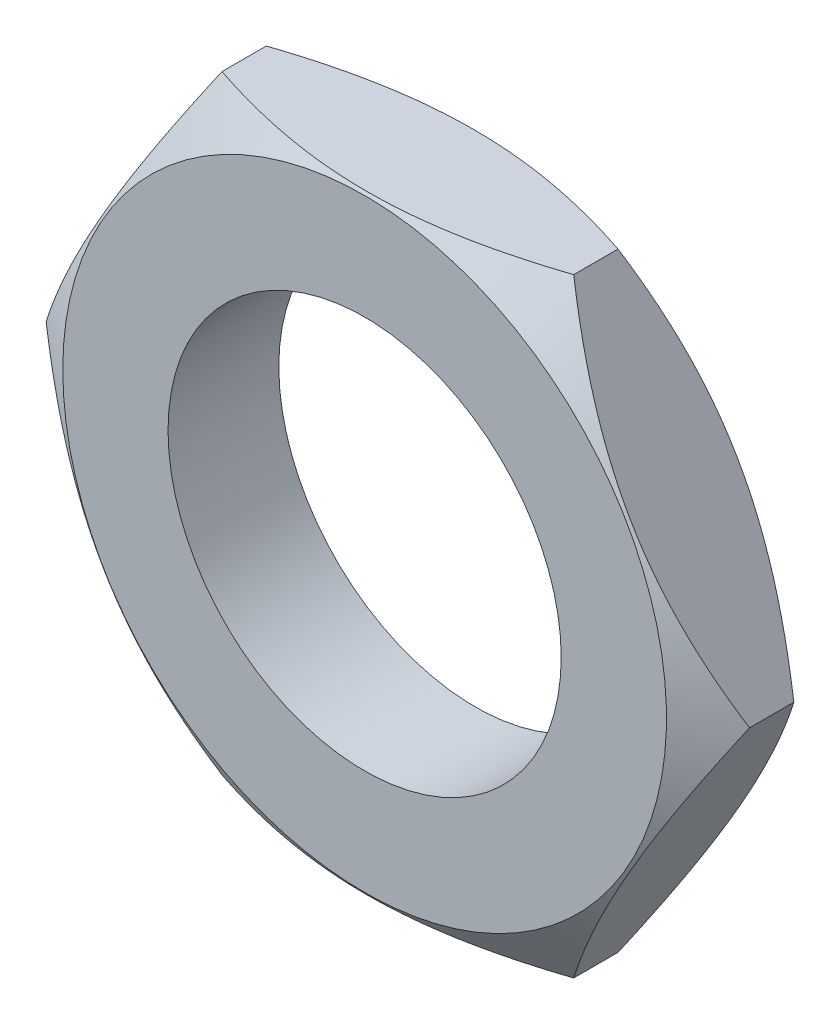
ISO-10303-21;
HEADER;
FILE_DESCRIPTION(('STEP AP214'),'2;1');
FILE_NAME('part.step','',(''),(''),'','','');
FILE_SCHEMA(('AUTOMOTIVE_DESIGN { 1 0 10303 214 1 1 1 1 }'));
ENDSEC;
DATA;
#1=APPLICATION_CONTEXT('core data for automotive mechanical design processes');
#2=APPLICATION_PROTOCOL_DEFINITION('international standard','automotive_design',2000,#1);
#3=PRODUCT_CONTEXT('',#1,'mechanical');
#4=PRODUCT('Part','Part','',(#3));
#5=PRODUCT_RELATED_PRODUCT_CATEGORY('part','',(#4));
#6=PRODUCT_DEFINITION_FORMATION('','',#4);
#7=PRODUCT_DEFINITION_CONTEXT('part definition',#1,'design');
#8=PRODUCT_DEFINITION('design','',#6,#7);
#9=PRODUCT_DEFINITION_SHAPE('','',#8);
#10=(LENGTH_UNIT() NAMED_UNIT(*) SI_UNIT(.MILLI.,.METRE.));
#11=(NAMED_UNIT(*) PLANE_ANGLE_UNIT() SI_UNIT($,.RADIAN.));
#12=(NAMED_UNIT(*) SI_UNIT($,.STERADIAN.) SOLID_ANGLE_UNIT());
#13=UNCERTAINTY_MEASURE_WITH_UNIT(LENGTH_MEASURE(1.E-05),#10,'distance_accuracy_value','');
#14=(GEOMETRIC_REPRESENTATION_CONTEXT(3) GLOBAL_UNCERTAINTY_ASSIGNED_CONTEXT((#13)) GLOBAL_UNIT_ASSIGNED_CONTEXT((#10,
#11,#12)) REPRESENTATION_CONTEXT('',''));
#15=CARTESIAN_POINT('',(0.,0.,0.));
#16=DIRECTION('',(0.,0.,1.));
#17=DIRECTION('',(1.,0.,0.));
#18=AXIS2_PLACEMENT_3D('',#15,#16,#17);
#19=CARTESIAN_POINT('',(0.,0.,-1.));
#20=DIRECTION('',(0.,0.,1.));
#21=DIRECTION('',(1.,0.,0.));
#22=AXIS2_PLACEMENT_3D('',#19,#20,#21);
#23=PLANE('',#22);
#24=CARTESIAN_POINT('',(0.,0.,-1.));
#25=DIRECTION('',(0.,0.,1.));
#26=DIRECTION('',(1.,0.,0.));
#27=AXIS2_PLACEMENT_3D('',#24,#25,#26);
#28=CIRCLE('',#27,3.55);
#29=CARTESIAN_POINT('',(3.55,0.,-1.));
#30=VERTEX_POINT('',#29);
#31=EDGE_CURVE('E218',#30,#30,#28,.T.);
#32=ORIENTED_EDGE('',*,*,#31,.T.);
#33=EDGE_LOOP('',(#32));
#34=FACE_BOUND('',#33,.T.);
#35=CARTESIAN_POINT('',(0.,0.,-1.));
#36=DIRECTION('',(0.,0.,-1.));
#37=DIRECTION('',(-1.,0.,0.));
#38=AXIS2_PLACEMENT_3D('',#35,#36,#37);
#39=CIRCLE('',#38,5.45085296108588);
#40=CARTESIAN_POINT('',(-5.45085296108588,0.,-1.));
#41=VERTEX_POINT('',#40);
#42=EDGE_CURVE('E106',#41,#41,#39,.T.);
#43=ORIENTED_EDGE('',*,*,#42,.T.);
#44=EDGE_LOOP('',(#43));
#45=FACE_BOUND('',#44,.T.);
#46=ADVANCED_FACE('F34',(#34,#45),#23,.F.);
#47=CARTESIAN_POINT('',(0.,0.,1.));
#48=DIRECTION('',(0.,0.,1.));
#49=DIRECTION('',(1.,0.,0.));
#50=AXIS2_PLACEMENT_3D('',#47,#48,#49);
#51=PLANE('',#50);
#52=CARTESIAN_POINT('',(0.,0.,1.));
#53=DIRECTION('',(0.,0.,1.));
#54=DIRECTION('',(1.,0.,0.));
#55=AXIS2_PLACEMENT_3D('',#52,#53,#54);
#56=CIRCLE('',#55,3.55);
#57=CARTESIAN_POINT('',(3.55,0.,1.));
#58=VERTEX_POINT('',#57);
#59=EDGE_CURVE('E113',#58,#58,#56,.T.);
#60=ORIENTED_EDGE('',*,*,#59,.F.);
#61=EDGE_LOOP('',(#60));
#62=FACE_BOUND('',#61,.T.);
#63=CARTESIAN_POINT('',(0.,0.,1.));
#64=DIRECTION('',(0.,0.,-1.));
#65=DIRECTION('',(-1.,0.,0.));
#66=AXIS2_PLACEMENT_3D('',#63,#64,#65);
#67=CIRCLE('',#66,5.45085296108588);
#68=CARTESIAN_POINT('',(-5.45085296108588,0.,1.));
#69=VERTEX_POINT('',#68);
#70=EDGE_CURVE('E205',#69,#69,#67,.T.);
#71=ORIENTED_EDGE('',*,*,#70,.F.);
#72=EDGE_LOOP('',(#71));
#73=FACE_BOUND('',#72,.T.);
#74=ADVANCED_FACE('F227',(#62,#73),#51,.T.);
#75=CARTESIAN_POINT('',(-3.17542648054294,-5.5,1.));
#76=DIRECTION('',(0.,1.,0.));
#77=DIRECTION('',(-1.,0.,0.));
#78=AXIS2_PLACEMENT_3D('',#75,#76,#77);
#79=PLANE('',#78);
#80=DIRECTION('',(0.,0.,-1.));
#81=VECTOR('',#80,1.);
#82=CARTESIAN_POINT('',(-3.17542648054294,-5.5,1.));
#83=LINE('',#82,#81);
#84=CARTESIAN_POINT('',(-3.17542648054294,-5.5,0.4));
#85=VERTEX_POINT('',#84);
#86=CARTESIAN_POINT('',(-3.17542648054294,-5.5,-0.4));
#87=VERTEX_POINT('',#86);
#88=EDGE_CURVE('E109',#85,#87,#83,.T.);
#89=ORIENTED_EDGE('',*,*,#88,.T.);
#90=CARTESIAN_POINT('',(-9.5547591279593,-5.5,2.71588024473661));
#91=CARTESIAN_POINT('',(-9.35509489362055,-5.5,2.60053035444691));
#92=CARTESIAN_POINT('',(-9.15504880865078,-5.5,2.48583631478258));
#93=CARTESIAN_POINT('',(-8.75404517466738,-5.5,2.25803181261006));
#94=CARTESIAN_POINT('',(-8.55308758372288,-5.5,2.14492142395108));
#95=CARTESIAN_POINT('',(-8.14987653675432,-5.5,1.92042480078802));
#96=CARTESIAN_POINT('',(-7.94762176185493,-5.5,1.80904093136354));
#97=CARTESIAN_POINT('',(-7.54189820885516,-5.5,1.58850994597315));
#98=CARTESIAN_POINT('',(-7.33842944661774,-5.5,1.47936280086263));
#99=CARTESIAN_POINT('',(-6.92243402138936,-5.5,1.25972394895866));
#100=CARTESIAN_POINT('',(-6.70985318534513,-5.5,1.14933461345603));
#101=CARTESIAN_POINT('',(-6.28289247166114,-5.5,0.932094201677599));
#102=CARTESIAN_POINT('',(-6.06851263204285,-5.5,0.825243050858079));
#103=CARTESIAN_POINT('',(-5.63770994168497,-5.5,0.615945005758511));
#104=CARTESIAN_POINT('',(-5.42128793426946,-5.5,0.513496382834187));
#105=CARTESIAN_POINT('',(-4.98595964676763,-5.5,0.314040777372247));
#106=CARTESIAN_POINT('',(-4.76705351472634,-5.5,0.217033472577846));
#107=CARTESIAN_POINT('',(-4.26228857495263,-5.5,0.00261700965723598));
#108=CARTESIAN_POINT('',(-3.97545712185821,-5.5,-0.112530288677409));
#109=CARTESIAN_POINT('',(-3.39600223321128,-5.5,-0.327579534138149));
#110=CARTESIAN_POINT('',(-3.1033779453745,-5.5,-0.427479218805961));
#111=CARTESIAN_POINT('',(-2.51549072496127,-5.5,-0.605664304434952));
#112=CARTESIAN_POINT('',(-2.22030656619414,-5.5,-0.684204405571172));
#113=CARTESIAN_POINT('',(-1.6241893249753,-5.5,-0.815283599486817));
#114=CARTESIAN_POINT('',(-1.32325928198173,-5.5,-0.867836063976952));
#115=CARTESIAN_POINT('',(-0.762627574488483,-5.5,-0.936011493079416));
#116=CARTESIAN_POINT('',(-0.503461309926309,-5.5,-0.955969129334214));
#117=CARTESIAN_POINT('',(0.0155937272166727,-5.5,-0.971292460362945));
#118=CARTESIAN_POINT('',(0.275482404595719,-5.5,-0.966661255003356));
#119=CARTESIAN_POINT('',(0.794655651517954,-5.5,-0.933188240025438));
#120=CARTESIAN_POINT('',(1.05393403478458,-5.5,-0.904253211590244));
#121=CARTESIAN_POINT('',(1.56907775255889,-5.5,-0.824609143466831));
#122=CARTESIAN_POINT('',(1.82494251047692,-5.5,-0.773896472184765));
#123=CARTESIAN_POINT('',(2.37050875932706,-5.5,-0.645326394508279));
#124=CARTESIAN_POINT('',(2.65950644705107,-5.5,-0.564532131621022));
#125=CARTESIAN_POINT('',(3.23174754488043,-5.5,-0.384434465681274));
#126=CARTESIAN_POINT('',(3.51498717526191,-5.5,-0.28511931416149));
#127=CARTESIAN_POINT('',(4.07680164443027,-5.5,-0.0723845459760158));
#128=CARTESIAN_POINT('',(4.35536416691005,-5.5,0.0410671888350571));
#129=CARTESIAN_POINT('',(4.90791823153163,-5.5,0.278351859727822));
#130=CARTESIAN_POINT('',(5.18191073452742,-5.5,0.402182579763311));
#131=CARTESIAN_POINT('',(5.7280639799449,-5.5,0.658561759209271));
#132=CARTESIAN_POINT('',(6.00019916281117,-5.5,0.791164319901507));
#133=CARTESIAN_POINT('',(6.54142916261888,-5.5,1.06243134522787));
#134=CARTESIAN_POINT('',(6.81052386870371,-5.5,1.2010960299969));
#135=CARTESIAN_POINT('',(7.34591891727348,-5.5,1.48294548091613));
#136=CARTESIAN_POINT('',(7.6122221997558,-5.5,1.62612468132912));
#137=CARTESIAN_POINT('',(8.14280963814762,-5.5,1.91615469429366));
#138=CARTESIAN_POINT('',(8.40709383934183,-5.5,2.06300542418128));
#139=CARTESIAN_POINT('',(8.81869803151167,-5.5,2.29472323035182));
#140=CARTESIAN_POINT('',(8.96658393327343,-5.5,2.37858820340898));
#141=CARTESIAN_POINT('',(9.26130104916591,-5.5,2.54681108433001));
#142=CARTESIAN_POINT('',(9.40813412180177,-5.5,2.63116573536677));
#143=CARTESIAN_POINT('',(9.5547591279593,-5.5,2.71588024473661));
#144=B_SPLINE_CURVE_WITH_KNOTS('',3,(#90,#91,#92,#93,#94,#95,#96,#97,#98,#99,#100,#101,#102,
#103,#104,#105,#106,#107,#108,#109,#110,#111,#112,#113,#114,#115,#116,#117,#118,#119,#120,#121,
#122,#123,#124,#125,#126,#127,#128,#129,#130,#131,#132,#133,#134,#135,#136,#137,#138,#139,#140,
#141,#142,#143),.UNSPECIFIED.,.F.,.F.,(4,2,2,2,2,2,2,2,2,2,2,2,2,2,2,2,2,2,2,2,2,2,2,2,2,2,4),
(0.,0.691770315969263,1.38357278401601,2.0762514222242,2.76892102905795,3.4874951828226,
4.20605418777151,4.92432842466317,5.6425600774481,6.56948051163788,7.4965383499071,
8.41200161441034,9.3269933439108,10.1056989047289,10.8843062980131,11.6659137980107,
12.447651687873,13.3470561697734,14.2470331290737,15.1490934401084,16.0509616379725,
16.9590327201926,17.867136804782,18.7741620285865,19.6811668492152,20.1911961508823,
20.6992102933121),.UNSPECIFIED.);
#145=CARTESIAN_POINT('',(3.17542648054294,-5.49999999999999,-0.4));
#146=VERTEX_POINT('',#145);
#147=EDGE_CURVE('E56',#87,#146,#144,.T.);
#148=ORIENTED_EDGE('',*,*,#147,.T.);
#149=DIRECTION('',(0.,0.,-1.));
#150=VECTOR('',#149,1.);
#151=CARTESIAN_POINT('',(3.17542648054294,-5.5,1.));
#152=LINE('',#151,#150);
#153=CARTESIAN_POINT('',(3.17542648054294,-5.49999999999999,0.4));
#154=VERTEX_POINT('',#153);
#155=EDGE_CURVE('E122',#154,#146,#152,.T.);
#156=ORIENTED_EDGE('',*,*,#155,.F.);
#157=CARTESIAN_POINT('',(9.5547591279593,-5.5,-2.71588024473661));
#158=CARTESIAN_POINT('',(9.35509489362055,-5.5,-2.60053035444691));
#159=CARTESIAN_POINT('',(9.15504880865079,-5.5,-2.48583631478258));
#160=CARTESIAN_POINT('',(8.75404517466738,-5.5,-2.25803181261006));
#161=CARTESIAN_POINT('',(8.55308758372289,-5.5,-2.14492142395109));
#162=CARTESIAN_POINT('',(8.14987653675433,-5.5,-1.92042480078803));
#163=CARTESIAN_POINT('',(7.94762176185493,-5.5,-1.80904093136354));
#164=CARTESIAN_POINT('',(7.54189820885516,-5.5,-1.58850994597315));
#165=CARTESIAN_POINT('',(7.33842944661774,-5.5,-1.47936280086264));
#166=CARTESIAN_POINT('',(6.92243402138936,-5.5,-1.25972394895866));
#167=CARTESIAN_POINT('',(6.70985318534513,-5.5,-1.14933461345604));
#168=CARTESIAN_POINT('',(6.28289247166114,-5.5,-0.932094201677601));
#169=CARTESIAN_POINT('',(6.06851263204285,-5.5,-0.825243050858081));
#170=CARTESIAN_POINT('',(5.63770994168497,-5.5,-0.615945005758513));
#171=CARTESIAN_POINT('',(5.42128793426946,-5.5,-0.51349638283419));
#172=CARTESIAN_POINT('',(4.98595964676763,-5.5,-0.314040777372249));
#173=CARTESIAN_POINT('',(4.76705351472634,-5.5,-0.217033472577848));
#174=CARTESIAN_POINT('',(4.26228857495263,-5.5,-0.00261700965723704));
#175=CARTESIAN_POINT('',(3.97545712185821,-5.5,0.112530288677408));
#176=CARTESIAN_POINT('',(3.39600223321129,-5.5,0.327579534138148));
#177=CARTESIAN_POINT('',(3.1033779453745,-5.5,0.42747921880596));
#178=CARTESIAN_POINT('',(2.51549072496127,-5.5,0.605664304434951));
#179=CARTESIAN_POINT('',(2.22030656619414,-5.5,0.684204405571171));
#180=CARTESIAN_POINT('',(1.6241893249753,-5.5,0.815283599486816));
#181=CARTESIAN_POINT('',(1.32325928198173,-5.5,0.867836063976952));
#182=CARTESIAN_POINT('',(0.762627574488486,-5.5,0.936011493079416));
#183=CARTESIAN_POINT('',(0.503461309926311,-5.5,0.955969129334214));
#184=CARTESIAN_POINT('',(-0.0155937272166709,-5.5,0.971292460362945));
#185=CARTESIAN_POINT('',(-0.275482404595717,-5.5,0.966661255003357));
#186=CARTESIAN_POINT('',(-0.794655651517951,-5.5,0.933188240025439));
#187=CARTESIAN_POINT('',(-1.05393403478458,-5.5,0.904253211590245));
#188=CARTESIAN_POINT('',(-1.56907775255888,-5.5,0.824609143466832));
#189=CARTESIAN_POINT('',(-1.82494251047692,-5.5,0.773896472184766));
#190=CARTESIAN_POINT('',(-2.37050875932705,-5.5,0.64532639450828));
#191=CARTESIAN_POINT('',(-2.65950644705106,-5.5,0.564532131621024));
#192=CARTESIAN_POINT('',(-3.23174754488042,-5.5,0.384434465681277));
#193=CARTESIAN_POINT('',(-3.5149871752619,-5.5,0.285119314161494));
#194=CARTESIAN_POINT('',(-4.07680164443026,-5.5,0.0723845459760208));
#195=CARTESIAN_POINT('',(-4.35536416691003,-5.5,-0.0410671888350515));
#196=CARTESIAN_POINT('',(-4.90791823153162,-5.5,-0.278351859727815));
#197=CARTESIAN_POINT('',(-5.1819107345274,-5.5,-0.402182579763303));
#198=CARTESIAN_POINT('',(-5.72806397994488,-5.5,-0.658561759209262));
#199=CARTESIAN_POINT('',(-6.00019916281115,-5.5,-0.791164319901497));
#200=CARTESIAN_POINT('',(-6.54142916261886,-5.5,-1.06243134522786));
#201=CARTESIAN_POINT('',(-6.81052386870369,-5.5,-1.20109602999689));
#202=CARTESIAN_POINT('',(-7.34591891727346,-5.5,-1.48294548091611));
#203=CARTESIAN_POINT('',(-7.61222219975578,-5.5,-1.62612468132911));
#204=CARTESIAN_POINT('',(-8.1428096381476,-5.5,-1.91615469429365));
#205=CARTESIAN_POINT('',(-8.4070938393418,-5.5,-2.06300542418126));
#206=CARTESIAN_POINT('',(-8.81869803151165,-5.5,-2.2947232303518));
#207=CARTESIAN_POINT('',(-8.96658393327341,-5.5,-2.37858820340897));
#208=CARTESIAN_POINT('',(-9.2613010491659,-5.5,-2.54681108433));
#209=CARTESIAN_POINT('',(-9.40813412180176,-5.5,-2.63116573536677));
#210=CARTESIAN_POINT('',(-9.5547591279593,-5.5,-2.71588024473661));
#211=B_SPLINE_CURVE_WITH_KNOTS('',3,(#157,#158,#159,#160,#161,#162,#163,#164,#165,#166,#167,
#168,#169,#170,#171,#172,#173,#174,#175,#176,#177,#178,#179,#180,#181,#182,#183,#184,#185,#186,
#187,#188,#189,#190,#191,#192,#193,#194,#195,#196,#197,#198,#199,#200,#201,#202,#203,#204,#205,
#206,#207,#208,#209,#210),.UNSPECIFIED.,.F.,.F.,(4,2,2,2,2,2,2,2,2,2,2,2,2,2,2,2,2,2,2,2,2,2,2,
2,2,2,4),(0.,0.691770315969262,1.38357278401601,2.0762514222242,2.76892102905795,
3.4874951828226,4.20605418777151,4.92432842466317,5.6425600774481,6.56948051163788,
7.4965383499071,8.41200161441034,9.32699334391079,10.1056989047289,10.8843062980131,
11.6659137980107,12.447651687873,13.3470561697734,14.2470331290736,15.1490934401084,
16.0509616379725,16.9590327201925,17.867136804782,18.7741620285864,19.6811668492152,
20.1911961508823,20.6992102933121),.UNSPECIFIED.);
#212=EDGE_CURVE('E173',#154,#85,#211,.T.);
#213=ORIENTED_EDGE('',*,*,#212,.T.);
#214=EDGE_LOOP('',(#89,#148,#156,#213));
#215=FACE_BOUND('',#214,.T.);
#216=ADVANCED_FACE('F36',(#215),#79,.F.);
#217=CARTESIAN_POINT('',(3.17542648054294,-5.5,1.));
#218=DIRECTION('',(-0.866025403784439,0.5,0.));
#219=DIRECTION('',(-0.5,-0.866025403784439,0.));
#220=AXIS2_PLACEMENT_3D('',#217,#218,#219);
#221=PLANE('',#220);
#222=ORIENTED_EDGE('',*,*,#155,.T.);
#223=CARTESIAN_POINT('',(3.1753110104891,-5.5002,-0.39992301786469));
#224=CARTESIAN_POINT('',(3.24610351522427,-5.37758378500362,-0.44710845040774));
#225=CARTESIAN_POINT('',(3.31724315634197,-5.25436631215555,-0.492180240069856));
#226=CARTESIAN_POINT('',(3.46029440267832,-5.00659428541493,-0.577457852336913));
#227=CARTESIAN_POINT('',(3.53220646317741,-4.88203894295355,-0.617660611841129));
#228=CARTESIAN_POINT('',(3.74951308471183,-4.50565283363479,-0.730142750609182));
#229=CARTESIAN_POINT('',(3.89605837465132,-4.25182894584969,-0.794007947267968));
#230=CARTESIAN_POINT('',(4.11518656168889,-3.87228779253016,-0.867960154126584));
#231=CARTESIAN_POINT('',(4.18688718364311,-3.74809867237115,-0.888787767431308));
#232=CARTESIAN_POINT('',(4.33071238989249,-3.49898610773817,-0.923377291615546));
#233=CARTESIAN_POINT('',(4.402836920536,-3.37406275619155,-0.937140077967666));
#234=CARTESIAN_POINT('',(4.54722743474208,-3.12397104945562,-0.957195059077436));
#235=CARTESIAN_POINT('',(4.61949298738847,-2.99880344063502,-0.963499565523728));
#236=CARTESIAN_POINT('',(4.76408302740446,-2.74836614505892,-0.968503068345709));
#237=CARTESIAN_POINT('',(4.83640751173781,-2.62309646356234,-0.967202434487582));
#238=CARTESIAN_POINT('',(5.02969483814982,-2.28831299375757,-0.953566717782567));
#239=CARTESIAN_POINT('',(5.15055061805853,-2.07898464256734,-0.934378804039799));
#240=CARTESIAN_POINT('',(5.3911764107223,-1.66220854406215,-0.876153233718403));
#241=CARTESIAN_POINT('',(5.51094485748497,-1.45476350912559,-0.837090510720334));
#242=CARTESIAN_POINT('',(5.75214666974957,-1.03698971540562,-0.740430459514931));
#243=CARTESIAN_POINT('',(5.87352855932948,-0.826750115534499,-0.682331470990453));
#244=CARTESIAN_POINT('',(6.11395261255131,-0.410323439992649,-0.551376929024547));
#245=CARTESIAN_POINT('',(6.23300017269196,-0.204127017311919,-0.478561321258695));
#246=CARTESIAN_POINT('',(6.35096843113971,0.000200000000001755,-0.399923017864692));
#247=B_SPLINE_CURVE_WITH_KNOTS('',3,(#223,#224,#225,#226,#227,#228,#229,#230,#231,#232,#233,
#234,#235,#236,#237,#238,#239,#240,#241,#242,#243,#244,#245,#246),.UNSPECIFIED.,.F.,.F.,(4,2,2,
2,2,2,2,2,2,2,2,4),(0.,0.447673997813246,0.895628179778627,1.79419326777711,2.22876982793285,
2.66329252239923,3.09709692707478,3.53088024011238,4.25733541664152,4.98470908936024,
5.73304291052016,6.47937215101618),.UNSPECIFIED.);
#248=CARTESIAN_POINT('',(6.35085296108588,0.,-0.4));
#249=VERTEX_POINT('',#248);
#250=EDGE_CURVE('E187',#146,#249,#247,.T.);
#251=ORIENTED_EDGE('',*,*,#250,.T.);
#252=DIRECTION('',(0.,0.,-1.));
#253=VECTOR('',#252,1.);
#254=CARTESIAN_POINT('',(6.35085296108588,0.,1.));
#255=LINE('',#254,#253);
#256=CARTESIAN_POINT('',(6.35085296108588,0.,0.4));
#257=VERTEX_POINT('',#256);
#258=EDGE_CURVE('E119',#257,#249,#255,.T.);
#259=ORIENTED_EDGE('',*,*,#258,.F.);
#260=CARTESIAN_POINT('',(6.35096843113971,0.000200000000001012,0.399923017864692));
#261=CARTESIAN_POINT('',(6.28017592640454,-0.12241621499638,0.447108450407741));
#262=CARTESIAN_POINT('',(6.20903628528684,-0.24563368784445,0.492180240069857));
#263=CARTESIAN_POINT('',(6.06598503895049,-0.49340571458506,0.577457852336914));
#264=CARTESIAN_POINT('',(5.99407297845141,-0.617961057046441,0.61766061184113));
#265=CARTESIAN_POINT('',(5.77676635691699,-0.994347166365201,0.730142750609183));
#266=CARTESIAN_POINT('',(5.6302210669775,-1.24817105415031,0.79400794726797));
#267=CARTESIAN_POINT('',(5.41109287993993,-1.62771220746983,0.867960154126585));
#268=CARTESIAN_POINT('',(5.3393922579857,-1.75190132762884,0.888787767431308));
#269=CARTESIAN_POINT('',(5.19556705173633,-2.00101389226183,0.923377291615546));
#270=CARTESIAN_POINT('',(5.12344252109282,-2.12593724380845,0.937140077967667));
#271=CARTESIAN_POINT('',(4.97905200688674,-2.37602895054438,0.957195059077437));
#272=CARTESIAN_POINT('',(4.90678645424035,-2.50119655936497,0.963499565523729));
#273=CARTESIAN_POINT('',(4.76219641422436,-2.75163385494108,0.968503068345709));
#274=CARTESIAN_POINT('',(4.68987192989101,-2.87690353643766,0.967202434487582));
#275=CARTESIAN_POINT('',(4.49658460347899,-3.21168700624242,0.953566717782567));
#276=CARTESIAN_POINT('',(4.37572882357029,-3.42101535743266,0.934378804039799));
#277=CARTESIAN_POINT('',(4.13510303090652,-3.83779145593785,0.876153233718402));
#278=CARTESIAN_POINT('',(4.01533458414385,-4.0452364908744,0.837090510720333));
#279=CARTESIAN_POINT('',(3.77413277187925,-4.46301028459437,0.74043045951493));
#280=CARTESIAN_POINT('',(3.65275088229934,-4.6732498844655,0.682331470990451));
#281=CARTESIAN_POINT('',(3.41232682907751,-5.08967656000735,0.551376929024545));
#282=CARTESIAN_POINT('',(3.29327926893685,-5.29587298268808,0.478561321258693));
#283=CARTESIAN_POINT('',(3.1753110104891,-5.5002,0.39992301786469));
#284=B_SPLINE_CURVE_WITH_KNOTS('',3,(#260,#261,#262,#263,#264,#265,#266,#267,#268,#269,#270,
#271,#272,#273,#274,#275,#276,#277,#278,#279,#280,#281,#282,#283),.UNSPECIFIED.,.F.,.F.,(4,2,2,
2,2,2,2,2,2,2,2,4),(0.,0.447673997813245,0.895628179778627,1.79419326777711,2.22876982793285,
2.66329252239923,3.09709692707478,3.53088024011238,4.25733541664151,4.98470908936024,
5.73304291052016,6.47937215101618),.UNSPECIFIED.);
#285=EDGE_CURVE('E167',#257,#154,#284,.T.);
#286=ORIENTED_EDGE('',*,*,#285,.T.);
#287=EDGE_LOOP('',(#222,#251,#259,#286));
#288=FACE_BOUND('',#287,.T.);
#289=ADVANCED_FACE('F179',(#288),#221,.F.);
#290=CARTESIAN_POINT('',(6.35085296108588,0.,1.));
#291=DIRECTION('',(-0.866025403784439,-0.5,0.));
#292=DIRECTION('',(0.5,-0.866025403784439,0.));
#293=AXIS2_PLACEMENT_3D('',#290,#291,#292);
#294=PLANE('',#293);
#295=ORIENTED_EDGE('',*,*,#258,.T.);
#296=CARTESIAN_POINT('',(6.35096843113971,-0.000199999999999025,-0.399923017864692));
#297=CARTESIAN_POINT('',(6.28017592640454,0.122416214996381,-0.447108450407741));
#298=CARTESIAN_POINT('',(6.20903628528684,0.245633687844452,-0.492180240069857));
#299=CARTESIAN_POINT('',(6.06598503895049,0.493405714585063,-0.577457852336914));
#300=CARTESIAN_POINT('',(5.99407297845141,0.617961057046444,-0.61766061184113));
#301=CARTESIAN_POINT('',(5.77676635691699,0.994347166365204,-0.730142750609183));
#302=CARTESIAN_POINT('',(5.6302210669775,1.24817105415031,-0.79400794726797));
#303=CARTESIAN_POINT('',(5.41109287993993,1.62771220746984,-0.867960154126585));
#304=CARTESIAN_POINT('',(5.3393922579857,1.75190132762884,-0.888787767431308));
#305=CARTESIAN_POINT('',(5.19556705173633,2.00101389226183,-0.923377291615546));
#306=CARTESIAN_POINT('',(5.12344252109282,2.12593724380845,-0.937140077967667));
#307=CARTESIAN_POINT('',(4.97905200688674,2.37602895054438,-0.957195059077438));
#308=CARTESIAN_POINT('',(4.90678645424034,2.50119655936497,-0.963499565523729));
#309=CARTESIAN_POINT('',(4.76219641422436,2.75163385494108,-0.96850306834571));
#310=CARTESIAN_POINT('',(4.68987192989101,2.87690353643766,-0.967202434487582));
#311=CARTESIAN_POINT('',(4.49658460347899,3.21168700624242,-0.953566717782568));
#312=CARTESIAN_POINT('',(4.37572882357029,3.42101535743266,-0.934378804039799));
#313=CARTESIAN_POINT('',(4.13510303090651,3.83779145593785,-0.876153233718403));
#314=CARTESIAN_POINT('',(4.01533458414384,4.0452364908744,-0.837090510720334));
#315=CARTESIAN_POINT('',(3.77413277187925,4.46301028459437,-0.740430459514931));
#316=CARTESIAN_POINT('',(3.65275088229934,4.6732498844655,-0.682331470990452));
#317=CARTESIAN_POINT('',(3.41232682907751,5.08967656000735,-0.551376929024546));
#318=CARTESIAN_POINT('',(3.29327926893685,5.29587298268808,-0.478561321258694));
#319=CARTESIAN_POINT('',(3.1753110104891,5.5002,-0.399923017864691));
#320=B_SPLINE_CURVE_WITH_KNOTS('',3,(#296,#297,#298,#299,#300,#301,#302,#303,#304,#305,#306,
#307,#308,#309,#310,#311,#312,#313,#314,#315,#316,#317,#318,#319),.UNSPECIFIED.,.F.,.F.,(4,2,2,
2,2,2,2,2,2,2,2,4),(0.,0.447673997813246,0.895628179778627,1.79419326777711,2.22876982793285,
2.66329252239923,3.09709692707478,3.53088024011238,4.25733541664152,4.98470908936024,
5.73304291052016,6.47937215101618),.UNSPECIFIED.);
#321=CARTESIAN_POINT('',(3.17542648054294,5.5,-0.4));
#322=VERTEX_POINT('',#321);
#323=EDGE_CURVE('E195',#249,#322,#320,.T.);
#324=ORIENTED_EDGE('',*,*,#323,.T.);
#325=DIRECTION('',(0.,0.,-1.));
#326=VECTOR('',#325,1.);
#327=CARTESIAN_POINT('',(3.17542648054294,5.5,1.));
#328=LINE('',#327,#326);
#329=CARTESIAN_POINT('',(3.17542648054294,5.5,0.4));
#330=VERTEX_POINT('',#329);
#331=EDGE_CURVE('E111',#330,#322,#328,.T.);
#332=ORIENTED_EDGE('',*,*,#331,.F.);
#333=CARTESIAN_POINT('',(3.1753110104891,5.5002,0.399923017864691));
#334=CARTESIAN_POINT('',(3.24610351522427,5.37758378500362,0.44710845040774));
#335=CARTESIAN_POINT('',(3.31724315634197,5.25436631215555,0.492180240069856));
#336=CARTESIAN_POINT('',(3.46029440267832,5.00659428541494,0.577457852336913));
#337=CARTESIAN_POINT('',(3.53220646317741,4.88203894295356,0.617660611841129));
#338=CARTESIAN_POINT('',(3.74951308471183,4.5056528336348,0.730142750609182));
#339=CARTESIAN_POINT('',(3.89605837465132,4.25182894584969,0.79400794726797));
#340=CARTESIAN_POINT('',(4.11518656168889,3.87228779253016,0.867960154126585));
#341=CARTESIAN_POINT('',(4.18688718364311,3.74809867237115,0.888787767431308));
#342=CARTESIAN_POINT('',(4.33071238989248,3.49898610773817,0.923377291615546));
#343=CARTESIAN_POINT('',(4.40283692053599,3.37406275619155,0.937140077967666));
#344=CARTESIAN_POINT('',(4.54722743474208,3.12397104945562,0.957195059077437));
#345=CARTESIAN_POINT('',(4.61949298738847,2.99880344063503,0.963499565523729));
#346=CARTESIAN_POINT('',(4.76408302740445,2.74836614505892,0.968503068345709));
#347=CARTESIAN_POINT('',(4.8364075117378,2.62309646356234,0.967202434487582));
#348=CARTESIAN_POINT('',(5.02969483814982,2.28831299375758,0.953566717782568));
#349=CARTESIAN_POINT('',(5.15055061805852,2.07898464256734,0.934378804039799));
#350=CARTESIAN_POINT('',(5.3911764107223,1.66220854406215,0.876153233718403));
#351=CARTESIAN_POINT('',(5.51094485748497,1.4547635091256,0.837090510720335));
#352=CARTESIAN_POINT('',(5.75214666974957,1.03698971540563,0.740430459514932));
#353=CARTESIAN_POINT('',(5.87352855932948,0.826750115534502,0.682331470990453));
#354=CARTESIAN_POINT('',(6.11395261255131,0.410323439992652,0.551376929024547));
#355=CARTESIAN_POINT('',(6.23300017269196,0.204127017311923,0.478561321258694));
#356=CARTESIAN_POINT('',(6.35096843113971,-0.000199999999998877,0.399923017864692));
#357=B_SPLINE_CURVE_WITH_KNOTS('',3,(#333,#334,#335,#336,#337,#338,#339,#340,#341,#342,#343,
#344,#345,#346,#347,#348,#349,#350,#351,#352,#353,#354,#355,#356),.UNSPECIFIED.,.F.,.F.,(4,2,2,
2,2,2,2,2,2,2,2,4),(0.,0.447673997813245,0.895628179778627,1.79419326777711,2.22876982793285,
2.66329252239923,3.09709692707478,3.53088024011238,4.25733541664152,4.98470908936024,
5.73304291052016,6.47937215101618),.UNSPECIFIED.);
#358=EDGE_CURVE('E160',#330,#257,#357,.T.);
#359=ORIENTED_EDGE('',*,*,#358,.T.);
#360=EDGE_LOOP('',(#295,#324,#332,#359));
#361=FACE_BOUND('',#360,.T.);
#362=ADVANCED_FACE('F182',(#361),#294,.F.);
#363=CARTESIAN_POINT('',(3.17542648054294,5.5,1.));
#364=DIRECTION('',(0.,-1.,0.));
#365=DIRECTION('',(1.,0.,0.));
#366=AXIS2_PLACEMENT_3D('',#363,#364,#365);
#367=PLANE('',#366);
#368=ORIENTED_EDGE('',*,*,#331,.T.);
#369=CARTESIAN_POINT('',(9.55475912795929,5.5,2.71588024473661));
#370=CARTESIAN_POINT('',(9.35509489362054,5.5,2.60053035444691));
#371=CARTESIAN_POINT('',(9.15504880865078,5.5,2.48583631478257));
#372=CARTESIAN_POINT('',(8.75404517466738,5.5,2.25803181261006));
#373=CARTESIAN_POINT('',(8.55308758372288,5.5,2.14492142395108));
#374=CARTESIAN_POINT('',(8.14987653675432,5.5,1.92042480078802));
#375=CARTESIAN_POINT('',(7.94762176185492,5.5,1.80904093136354));
#376=CARTESIAN_POINT('',(7.54189820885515,5.5,1.58850994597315));
#377=CARTESIAN_POINT('',(7.33842944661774,5.5,1.47936280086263));
#378=CARTESIAN_POINT('',(6.92243402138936,5.5,1.25972394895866));
#379=CARTESIAN_POINT('',(6.70985318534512,5.5,1.14933461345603));
#380=CARTESIAN_POINT('',(6.28289247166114,5.5,0.932094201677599));
#381=CARTESIAN_POINT('',(6.06851263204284,5.5,0.825243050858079));
#382=CARTESIAN_POINT('',(5.63770994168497,5.5,0.615945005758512));
#383=CARTESIAN_POINT('',(5.42128793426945,5.5,0.513496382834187));
#384=CARTESIAN_POINT('',(4.98595964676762,5.5,0.314040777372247));
#385=CARTESIAN_POINT('',(4.76705351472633,5.5,0.217033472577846));
#386=CARTESIAN_POINT('',(4.26228857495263,5.5,0.0026170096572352));
#387=CARTESIAN_POINT('',(3.9754571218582,5.5,-0.11253028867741));
#388=CARTESIAN_POINT('',(3.39600223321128,5.5,-0.32757953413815));
#389=CARTESIAN_POINT('',(3.1033779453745,5.5,-0.427479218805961));
#390=CARTESIAN_POINT('',(2.51549072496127,5.5,-0.605664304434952));
#391=CARTESIAN_POINT('',(2.22030656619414,5.5,-0.684204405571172));
#392=CARTESIAN_POINT('',(1.62418932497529,5.5,-0.815283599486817));
#393=CARTESIAN_POINT('',(1.32325928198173,5.5,-0.867836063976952));
#394=CARTESIAN_POINT('',(0.76262757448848,5.5,-0.936011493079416));
#395=CARTESIAN_POINT('',(0.503461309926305,5.5,-0.955969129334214));
#396=CARTESIAN_POINT('',(-0.0155937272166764,5.5,-0.971292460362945));
#397=CARTESIAN_POINT('',(-0.275482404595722,5.5,-0.966661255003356));
#398=CARTESIAN_POINT('',(-0.794655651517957,5.5,-0.933188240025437));
#399=CARTESIAN_POINT('',(-1.05393403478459,5.5,-0.904253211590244));
#400=CARTESIAN_POINT('',(-1.56907775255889,5.5,-0.82460914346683));
#401=CARTESIAN_POINT('',(-1.82494251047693,5.5,-0.773896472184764));
#402=CARTESIAN_POINT('',(-2.37050875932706,5.5,-0.645326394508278));
#403=CARTESIAN_POINT('',(-2.65950644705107,5.5,-0.564532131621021));
#404=CARTESIAN_POINT('',(-3.23174754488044,5.5,-0.384434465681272));
#405=CARTESIAN_POINT('',(-3.51498717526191,5.5,-0.285119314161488));
#406=CARTESIAN_POINT('',(-4.07680164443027,5.5,-0.0723845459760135));
#407=CARTESIAN_POINT('',(-4.35536416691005,5.5,0.0410671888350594));
#408=CARTESIAN_POINT('',(-4.90791823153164,5.5,0.278351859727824));
#409=CARTESIAN_POINT('',(-5.18191073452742,5.5,0.402182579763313));
#410=CARTESIAN_POINT('',(-5.72806397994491,5.5,0.658561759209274));
#411=CARTESIAN_POINT('',(-6.00019916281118,5.5,0.79116431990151));
#412=CARTESIAN_POINT('',(-6.54142916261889,5.5,1.06243134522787));
#413=CARTESIAN_POINT('',(-6.81052386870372,5.5,1.20109602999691));
#414=CARTESIAN_POINT('',(-7.34591891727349,5.5,1.48294548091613));
#415=CARTESIAN_POINT('',(-7.61222219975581,5.5,1.62612468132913));
#416=CARTESIAN_POINT('',(-8.14280963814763,5.5,1.91615469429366));
#417=CARTESIAN_POINT('',(-8.40709383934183,5.5,2.06300542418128));
#418=CARTESIAN_POINT('',(-8.81869803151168,5.5,2.29472323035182));
#419=CARTESIAN_POINT('',(-8.96658393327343,5.5,2.37858820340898));
#420=CARTESIAN_POINT('',(-9.26130104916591,5.5,2.54681108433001));
#421=CARTESIAN_POINT('',(-9.40813412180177,5.5,2.63116573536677));
#422=CARTESIAN_POINT('',(-9.5547591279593,5.5,2.71588024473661));
#423=B_SPLINE_CURVE_WITH_KNOTS('',3,(#369,#370,#371,#372,#373,#374,#375,#376,#377,#378,#379,
#380,#381,#382,#383,#384,#385,#386,#387,#388,#389,#390,#391,#392,#393,#394,#395,#396,#397,#398,
#399,#400,#401,#402,#403,#404,#405,#406,#407,#408,#409,#410,#411,#412,#413,#414,#415,#416,#417,
#418,#419,#420,#421,#422),.UNSPECIFIED.,.F.,.F.,(4,2,2,2,2,2,2,2,2,2,2,2,2,2,2,2,2,2,2,2,2,2,2,
2,2,2,4),(0.,0.691770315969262,1.38357278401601,2.07625142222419,2.76892102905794,
3.4874951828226,4.20605418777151,4.92432842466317,5.6425600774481,6.56948051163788,
7.4965383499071,8.41200161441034,9.32699334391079,10.1056989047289,10.884306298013,
11.6659137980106,12.447651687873,13.3470561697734,14.2470331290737,15.1490934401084,
16.0509616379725,16.9590327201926,17.867136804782,18.7741620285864,19.6811668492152,
20.1911961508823,20.6992102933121),.UNSPECIFIED.);
#424=CARTESIAN_POINT('',(-3.17542648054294,5.49999999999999,-0.4));
#425=VERTEX_POINT('',#424);
#426=EDGE_CURVE('E105',#322,#425,#423,.T.);
#427=ORIENTED_EDGE('',*,*,#426,.T.);
#428=DIRECTION('',(0.,0.,-1.));
#429=VECTOR('',#428,1.);
#430=CARTESIAN_POINT('',(-3.17542648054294,5.5,1.));
#431=LINE('',#430,#429);
#432=CARTESIAN_POINT('',(-3.17542648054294,5.49999999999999,0.4));
#433=VERTEX_POINT('',#432);
#434=EDGE_CURVE('E104',#433,#425,#431,.T.);
#435=ORIENTED_EDGE('',*,*,#434,.F.);
#436=CARTESIAN_POINT('',(-9.5547591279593,5.5,-2.71588024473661));
#437=CARTESIAN_POINT('',(-9.35509489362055,5.5,-2.60053035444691));
#438=CARTESIAN_POINT('',(-9.15504880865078,5.5,-2.48583631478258));
#439=CARTESIAN_POINT('',(-8.75404517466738,5.5,-2.25803181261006));
#440=CARTESIAN_POINT('',(-8.55308758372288,5.5,-2.14492142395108));
#441=CARTESIAN_POINT('',(-8.14987653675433,5.5,-1.92042480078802));
#442=CARTESIAN_POINT('',(-7.94762176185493,5.5,-1.80904093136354));
#443=CARTESIAN_POINT('',(-7.54189820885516,5.5,-1.58850994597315));
#444=CARTESIAN_POINT('',(-7.33842944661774,5.5,-1.47936280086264));
#445=CARTESIAN_POINT('',(-6.92243402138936,5.5,-1.25972394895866));
#446=CARTESIAN_POINT('',(-6.70985318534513,5.5,-1.14933461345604));
#447=CARTESIAN_POINT('',(-6.28289247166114,5.5,-0.932094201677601));
#448=CARTESIAN_POINT('',(-6.06851263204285,5.5,-0.82524305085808));
#449=CARTESIAN_POINT('',(-5.63770994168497,5.5,-0.615945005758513));
#450=CARTESIAN_POINT('',(-5.42128793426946,5.5,-0.51349638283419));
#451=CARTESIAN_POINT('',(-4.98595964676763,5.5,-0.314040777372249));
#452=CARTESIAN_POINT('',(-4.76705351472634,5.5,-0.217033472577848));
#453=CARTESIAN_POINT('',(-4.26228857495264,5.5,-0.00261700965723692));
#454=CARTESIAN_POINT('',(-3.97545712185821,5.5,0.112530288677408));
#455=CARTESIAN_POINT('',(-3.39600223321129,5.5,0.327579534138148));
#456=CARTESIAN_POINT('',(-3.1033779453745,5.5,0.42747921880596));
#457=CARTESIAN_POINT('',(-2.51549072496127,5.5,0.605664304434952));
#458=CARTESIAN_POINT('',(-2.22030656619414,5.5,0.684204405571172));
#459=CARTESIAN_POINT('',(-1.6241893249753,5.5,0.815283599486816));
#460=CARTESIAN_POINT('',(-1.32325928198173,5.5,0.867836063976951));
#461=CARTESIAN_POINT('',(-0.762627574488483,5.5,0.936011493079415));
#462=CARTESIAN_POINT('',(-0.503461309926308,5.5,0.955969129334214));
#463=CARTESIAN_POINT('',(0.015593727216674,5.5,0.971292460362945));
#464=CARTESIAN_POINT('',(0.27548240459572,5.5,0.966661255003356));
#465=CARTESIAN_POINT('',(0.794655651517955,5.5,0.933188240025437));
#466=CARTESIAN_POINT('',(1.05393403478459,5.5,0.904253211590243));
#467=CARTESIAN_POINT('',(1.56907775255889,5.5,0.82460914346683));
#468=CARTESIAN_POINT('',(1.82494251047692,5.5,0.773896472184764));
#469=CARTESIAN_POINT('',(2.37050875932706,5.5,0.645326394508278));
#470=CARTESIAN_POINT('',(2.65950644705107,5.5,0.564532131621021));
#471=CARTESIAN_POINT('',(3.23174754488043,5.5,0.384434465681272));
#472=CARTESIAN_POINT('',(3.51498717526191,5.5,0.285119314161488));
#473=CARTESIAN_POINT('',(4.07680164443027,5.5,0.0723845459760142));
#474=CARTESIAN_POINT('',(4.35536416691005,5.5,-0.0410671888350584));
#475=CARTESIAN_POINT('',(4.90791823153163,5.5,-0.278351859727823));
#476=CARTESIAN_POINT('',(5.18191073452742,5.5,-0.402182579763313));
#477=CARTESIAN_POINT('',(5.7280639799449,5.5,-0.658561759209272));
#478=CARTESIAN_POINT('',(6.00019916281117,5.5,-0.791164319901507));
#479=CARTESIAN_POINT('',(6.54142916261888,5.5,-1.06243134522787));
#480=CARTESIAN_POINT('',(6.81052386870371,5.5,-1.2010960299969));
#481=CARTESIAN_POINT('',(7.34591891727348,5.5,-1.48294548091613));
#482=CARTESIAN_POINT('',(7.61222219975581,5.5,-1.62612468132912));
#483=CARTESIAN_POINT('',(8.14280963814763,5.5,-1.91615469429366));
#484=CARTESIAN_POINT('',(8.40709383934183,5.5,-2.06300542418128));
#485=CARTESIAN_POINT('',(8.81869803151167,5.5,-2.29472323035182));
#486=CARTESIAN_POINT('',(8.96658393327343,5.5,-2.37858820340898));
#487=CARTESIAN_POINT('',(9.26130104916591,5.5,-2.54681108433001));
#488=CARTESIAN_POINT('',(9.40813412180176,5.5,-2.63116573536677));
#489=CARTESIAN_POINT('',(9.55475912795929,5.5,-2.71588024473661));
#490=B_SPLINE_CURVE_WITH_KNOTS('',3,(#436,#437,#438,#439,#440,#441,#442,#443,#444,#445,#446,
#447,#448,#449,#450,#451,#452,#453,#454,#455,#456,#457,#458,#459,#460,#461,#462,#463,#464,#465,
#466,#467,#468,#469,#470,#471,#472,#473,#474,#475,#476,#477,#478,#479,#480,#481,#482,#483,#484,
#485,#486,#487,#488,#489),.UNSPECIFIED.,.F.,.F.,(4,2,2,2,2,2,2,2,2,2,2,2,2,2,2,2,2,2,2,2,2,2,2,
2,2,2,4),(0.,0.691770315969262,1.38357278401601,2.0762514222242,2.76892102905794,
3.4874951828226,4.20605418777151,4.92432842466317,5.6425600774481,6.56948051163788,
7.4965383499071,8.41200161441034,9.32699334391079,10.1056989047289,10.8843062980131,
11.6659137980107,12.447651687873,13.3470561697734,14.2470331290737,15.1490934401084,
16.0509616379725,16.9590327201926,17.867136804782,18.7741620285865,19.6811668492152,
20.1911961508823,20.6992102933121),.UNSPECIFIED.);
#491=EDGE_CURVE('E153',#433,#330,#490,.T.);
#492=ORIENTED_EDGE('',*,*,#491,.T.);
#493=EDGE_LOOP('',(#368,#427,#435,#492));
#494=FACE_BOUND('',#493,.T.);
#495=ADVANCED_FACE('F251',(#494),#367,.F.);
#496=CARTESIAN_POINT('',(-3.17542648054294,5.5,1.));
#497=DIRECTION('',(0.866025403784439,-0.5,0.));
#498=DIRECTION('',(0.5,0.866025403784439,0.));
#499=AXIS2_PLACEMENT_3D('',#496,#497,#498);
#500=PLANE('',#499);
#501=ORIENTED_EDGE('',*,*,#434,.T.);
#502=CARTESIAN_POINT('',(-3.1753110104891,5.5002,-0.39992301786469));
#503=CARTESIAN_POINT('',(-3.24610351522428,5.37758378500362,-0.44710845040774));
#504=CARTESIAN_POINT('',(-3.31724315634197,5.25436631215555,-0.492180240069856));
#505=CARTESIAN_POINT('',(-3.46029440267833,5.00659428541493,-0.577457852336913));
#506=CARTESIAN_POINT('',(-3.53220646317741,4.88203894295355,-0.617660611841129));
#507=CARTESIAN_POINT('',(-3.74951308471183,4.50565283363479,-0.730142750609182));
#508=CARTESIAN_POINT('',(-3.89605837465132,4.25182894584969,-0.794007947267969));
#509=CARTESIAN_POINT('',(-4.11518656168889,3.87228779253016,-0.867960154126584));
#510=CARTESIAN_POINT('',(-4.18688718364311,3.74809867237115,-0.888787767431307));
#511=CARTESIAN_POINT('',(-4.33071238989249,3.49898610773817,-0.923377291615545));
#512=CARTESIAN_POINT('',(-4.402836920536,3.37406275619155,-0.937140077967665));
#513=CARTESIAN_POINT('',(-4.54722743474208,3.12397104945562,-0.957195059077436));
#514=CARTESIAN_POINT('',(-4.61949298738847,2.99880344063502,-0.963499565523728));
#515=CARTESIAN_POINT('',(-4.76408302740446,2.74836614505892,-0.968503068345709));
#516=CARTESIAN_POINT('',(-4.83640751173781,2.62309646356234,-0.967202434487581));
#517=CARTESIAN_POINT('',(-5.02969483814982,2.28831299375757,-0.953566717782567));
#518=CARTESIAN_POINT('',(-5.15055061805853,2.07898464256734,-0.934378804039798));
#519=CARTESIAN_POINT('',(-5.3911764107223,1.66220854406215,-0.876153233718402));
#520=CARTESIAN_POINT('',(-5.51094485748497,1.4547635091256,-0.837090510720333));
#521=CARTESIAN_POINT('',(-5.75214666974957,1.03698971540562,-0.74043045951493));
#522=CARTESIAN_POINT('',(-5.87352855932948,0.8267501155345,-0.682331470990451));
#523=CARTESIAN_POINT('',(-6.11395261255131,0.41032343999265,-0.551376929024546));
#524=CARTESIAN_POINT('',(-6.23300017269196,0.20412701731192,-0.478561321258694));
#525=CARTESIAN_POINT('',(-6.35096843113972,-0.000200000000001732,-0.399923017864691));
#526=B_SPLINE_CURVE_WITH_KNOTS('',3,(#502,#503,#504,#505,#506,#507,#508,#509,#510,#511,#512,
#513,#514,#515,#516,#517,#518,#519,#520,#521,#522,#523,#524,#525),.UNSPECIFIED.,.F.,.F.,(4,2,2,
2,2,2,2,2,2,2,2,4),(0.,0.447673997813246,0.895628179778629,1.79419326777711,2.22876982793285,
2.66329252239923,3.09709692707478,3.53088024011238,4.25733541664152,4.98470908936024,
5.73304291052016,6.47937215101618),.UNSPECIFIED.);
#527=CARTESIAN_POINT('',(-6.35085296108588,0.,-0.4));
#528=VERTEX_POINT('',#527);
#529=EDGE_CURVE('E92',#425,#528,#526,.T.);
#530=ORIENTED_EDGE('',*,*,#529,.T.);
#531=DIRECTION('',(0.,0.,-1.));
#532=VECTOR('',#531,1.);
#533=CARTESIAN_POINT('',(-6.35085296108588,0.,1.));
#534=LINE('',#533,#532);
#535=CARTESIAN_POINT('',(-6.35085296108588,0.,0.4));
#536=VERTEX_POINT('',#535);
#537=EDGE_CURVE('E102',#536,#528,#534,.T.);
#538=ORIENTED_EDGE('',*,*,#537,.F.);
#539=CARTESIAN_POINT('',(-6.35096843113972,-0.00020000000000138,0.399923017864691));
#540=CARTESIAN_POINT('',(-6.28017592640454,0.122416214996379,0.447108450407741));
#541=CARTESIAN_POINT('',(-6.20903628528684,0.245633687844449,0.492180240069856));
#542=CARTESIAN_POINT('',(-6.06598503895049,0.493405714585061,0.577457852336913));
#543=CARTESIAN_POINT('',(-5.99407297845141,0.617961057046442,0.617660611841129));
#544=CARTESIAN_POINT('',(-5.77676635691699,0.994347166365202,0.730142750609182));
#545=CARTESIAN_POINT('',(-5.6302210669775,1.24817105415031,0.794007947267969));
#546=CARTESIAN_POINT('',(-5.41109287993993,1.62771220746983,0.867960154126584));
#547=CARTESIAN_POINT('',(-5.3393922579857,1.75190132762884,0.888787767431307));
#548=CARTESIAN_POINT('',(-5.19556705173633,2.00101389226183,0.923377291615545));
#549=CARTESIAN_POINT('',(-5.12344252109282,2.12593724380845,0.937140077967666));
#550=CARTESIAN_POINT('',(-4.97905200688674,2.37602895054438,0.957195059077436));
#551=CARTESIAN_POINT('',(-4.90678645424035,2.50119655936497,0.963499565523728));
#552=CARTESIAN_POINT('',(-4.76219641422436,2.75163385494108,0.968503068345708));
#553=CARTESIAN_POINT('',(-4.68987192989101,2.87690353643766,0.967202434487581));
#554=CARTESIAN_POINT('',(-4.496584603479,3.21168700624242,0.953566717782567));
#555=CARTESIAN_POINT('',(-4.37572882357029,3.42101535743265,0.934378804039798));
#556=CARTESIAN_POINT('',(-4.13510303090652,3.83779145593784,0.876153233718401));
#557=CARTESIAN_POINT('',(-4.01533458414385,4.0452364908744,0.837090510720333));
#558=CARTESIAN_POINT('',(-3.77413277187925,4.46301028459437,0.740430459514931));
#559=CARTESIAN_POINT('',(-3.65275088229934,4.6732498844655,0.682331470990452));
#560=CARTESIAN_POINT('',(-3.41232682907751,5.08967656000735,0.551376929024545));
#561=CARTESIAN_POINT('',(-3.29327926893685,5.29587298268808,0.478561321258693));
#562=CARTESIAN_POINT('',(-3.1753110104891,5.5002,0.39992301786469));
#563=B_SPLINE_CURVE_WITH_KNOTS('',3,(#539,#540,#541,#542,#543,#544,#545,#546,#547,#548,#549,
#550,#551,#552,#553,#554,#555,#556,#557,#558,#559,#560,#561,#562),.UNSPECIFIED.,.F.,.F.,(4,2,2,
2,2,2,2,2,2,2,2,4),(0.,0.447673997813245,0.895628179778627,1.79419326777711,2.22876982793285,
2.66329252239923,3.09709692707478,3.53088024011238,4.25733541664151,4.98470908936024,
5.73304291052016,6.47937215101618),.UNSPECIFIED.);
#564=EDGE_CURVE('E63',#536,#433,#563,.T.);
#565=ORIENTED_EDGE('',*,*,#564,.T.);
#566=EDGE_LOOP('',(#501,#530,#538,#565));
#567=FACE_BOUND('',#566,.T.);
#568=ADVANCED_FACE('F101',(#567),#500,.F.);
#569=CARTESIAN_POINT('',(-6.35085296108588,0.,1.));
#570=DIRECTION('',(0.866025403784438,0.5,0.));
#571=DIRECTION('',(-0.5,0.866025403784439,0.));
#572=AXIS2_PLACEMENT_3D('',#569,#570,#571);
#573=PLANE('',#572);
#574=ORIENTED_EDGE('',*,*,#537,.T.);
#575=CARTESIAN_POINT('',(-6.35096843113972,0.000199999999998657,-0.399923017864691));
#576=CARTESIAN_POINT('',(-6.28017592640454,-0.122416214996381,-0.44710845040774));
#577=CARTESIAN_POINT('',(-6.20903628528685,-0.245633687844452,-0.492180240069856));
#578=CARTESIAN_POINT('',(-6.06598503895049,-0.493405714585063,-0.577457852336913));
#579=CARTESIAN_POINT('',(-5.99407297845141,-0.617961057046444,-0.617660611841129));
#580=CARTESIAN_POINT('',(-5.77676635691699,-0.994347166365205,-0.730142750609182));
#581=CARTESIAN_POINT('',(-5.6302210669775,-1.24817105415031,-0.794007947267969));
#582=CARTESIAN_POINT('',(-5.41109287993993,-1.62771220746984,-0.867960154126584));
#583=CARTESIAN_POINT('',(-5.3393922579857,-1.75190132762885,-0.888787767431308));
#584=CARTESIAN_POINT('',(-5.19556705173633,-2.00101389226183,-0.923377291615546));
#585=CARTESIAN_POINT('',(-5.12344252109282,-2.12593724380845,-0.937140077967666));
#586=CARTESIAN_POINT('',(-4.97905200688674,-2.37602895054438,-0.957195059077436));
#587=CARTESIAN_POINT('',(-4.90678645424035,-2.50119655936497,-0.963499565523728));
#588=CARTESIAN_POINT('',(-4.76219641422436,-2.75163385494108,-0.968503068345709));
#589=CARTESIAN_POINT('',(-4.68987192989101,-2.87690353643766,-0.967202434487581));
#590=CARTESIAN_POINT('',(-4.49658460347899,-3.21168700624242,-0.953566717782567));
#591=CARTESIAN_POINT('',(-4.37572882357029,-3.42101535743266,-0.934378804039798));
#592=CARTESIAN_POINT('',(-4.13510303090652,-3.83779145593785,-0.876153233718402));
#593=CARTESIAN_POINT('',(-4.01533458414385,-4.0452364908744,-0.837090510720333));
#594=CARTESIAN_POINT('',(-3.77413277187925,-4.46301028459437,-0.740430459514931));
#595=CARTESIAN_POINT('',(-3.65275088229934,-4.6732498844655,-0.682331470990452));
#596=CARTESIAN_POINT('',(-3.41232682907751,-5.08967656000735,-0.551376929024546));
#597=CARTESIAN_POINT('',(-3.29327926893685,-5.29587298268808,-0.478561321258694));
#598=CARTESIAN_POINT('',(-3.1753110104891,-5.5002,-0.399923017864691));
#599=B_SPLINE_CURVE_WITH_KNOTS('',3,(#575,#576,#577,#578,#579,#580,#581,#582,#583,#584,#585,
#586,#587,#588,#589,#590,#591,#592,#593,#594,#595,#596,#597,#598),.UNSPECIFIED.,.F.,.F.,(4,2,2,
2,2,2,2,2,2,2,2,4),(0.,0.447673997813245,0.895628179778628,1.79419326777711,2.22876982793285,
2.66329252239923,3.09709692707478,3.53088024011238,4.25733541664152,4.98470908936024,
5.73304291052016,6.47937215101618),.UNSPECIFIED.);
#600=EDGE_CURVE('E11',#528,#87,#599,.T.);
#601=ORIENTED_EDGE('',*,*,#600,.T.);
#602=ORIENTED_EDGE('',*,*,#88,.F.);
#603=CARTESIAN_POINT('',(-3.1753110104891,-5.5002,0.399923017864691));
#604=CARTESIAN_POINT('',(-3.24610351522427,-5.37758378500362,0.447108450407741));
#605=CARTESIAN_POINT('',(-3.31724315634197,-5.25436631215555,0.492180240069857));
#606=CARTESIAN_POINT('',(-3.46029440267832,-5.00659428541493,0.577457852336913));
#607=CARTESIAN_POINT('',(-3.53220646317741,-4.88203894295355,0.617660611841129));
#608=CARTESIAN_POINT('',(-3.74951308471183,-4.50565283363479,0.730142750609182));
#609=CARTESIAN_POINT('',(-3.89605837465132,-4.25182894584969,0.79400794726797));
#610=CARTESIAN_POINT('',(-4.11518656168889,-3.87228779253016,0.867960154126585));
#611=CARTESIAN_POINT('',(-4.18688718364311,-3.74809867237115,0.888787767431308));
#612=CARTESIAN_POINT('',(-4.33071238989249,-3.49898610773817,0.923377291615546));
#613=CARTESIAN_POINT('',(-4.402836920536,-3.37406275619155,0.937140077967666));
#614=CARTESIAN_POINT('',(-4.54722743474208,-3.12397104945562,0.957195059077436));
#615=CARTESIAN_POINT('',(-4.61949298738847,-2.99880344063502,0.963499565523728));
#616=CARTESIAN_POINT('',(-4.76408302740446,-2.74836614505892,0.968503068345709));
#617=CARTESIAN_POINT('',(-4.83640751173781,-2.62309646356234,0.967202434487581));
#618=CARTESIAN_POINT('',(-5.02969483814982,-2.28831299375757,0.953566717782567));
#619=CARTESIAN_POINT('',(-5.15055061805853,-2.07898464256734,0.934378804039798));
#620=CARTESIAN_POINT('',(-5.3911764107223,-1.66220854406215,0.876153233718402));
#621=CARTESIAN_POINT('',(-5.51094485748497,-1.4547635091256,0.837090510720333));
#622=CARTESIAN_POINT('',(-5.75214666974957,-1.03698971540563,0.740430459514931));
#623=CARTESIAN_POINT('',(-5.87352855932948,-0.826750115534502,0.682331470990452));
#624=CARTESIAN_POINT('',(-6.11395261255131,-0.410323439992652,0.551376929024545));
#625=CARTESIAN_POINT('',(-6.23300017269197,-0.204127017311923,0.478561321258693));
#626=CARTESIAN_POINT('',(-6.35096843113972,0.000199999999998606,0.399923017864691));
#627=B_SPLINE_CURVE_WITH_KNOTS('',3,(#603,#604,#605,#606,#607,#608,#609,#610,#611,#612,#613,
#614,#615,#616,#617,#618,#619,#620,#621,#622,#623,#624,#625,#626),.UNSPECIFIED.,.F.,.F.,(4,2,2,
2,2,2,2,2,2,2,2,4),(0.,0.447673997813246,0.895628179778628,1.79419326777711,2.22876982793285,
2.66329252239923,3.09709692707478,3.53088024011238,4.25733541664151,4.98470908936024,
5.73304291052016,6.47937215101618),.UNSPECIFIED.);
#628=EDGE_CURVE('E49',#85,#536,#627,.T.);
#629=ORIENTED_EDGE('',*,*,#628,.T.);
#630=EDGE_LOOP('',(#574,#601,#602,#629));
#631=FACE_BOUND('',#630,.T.);
#632=ADVANCED_FACE('F108',(#631),#573,.F.);
#633=CARTESIAN_POINT('',(0.,0.,1.));
#634=DIRECTION('',(0.,0.,-1.));
#635=DIRECTION('',(-1.,0.,0.));
#636=AXIS2_PLACEMENT_3D('',#633,#634,#635);
#637=CYLINDRICAL_SURFACE('',#636,3.55);
#638=ORIENTED_EDGE('',*,*,#59,.T.);
#639=EDGE_LOOP('',(#638));
#640=FACE_BOUND('',#639,.T.);
#641=ORIENTED_EDGE('',*,*,#31,.F.);
#642=EDGE_LOOP('',(#641));
#643=FACE_BOUND('',#642,.T.);
#644=ADVANCED_FACE('F136',(#640,#643),#637,.F.);
#645=CARTESIAN_POINT('',(0.,0.,1.));
#646=DIRECTION('',(0.,0.,-1.));
#647=DIRECTION('',(-1.,0.,0.));
#648=AXIS2_PLACEMENT_3D('',#645,#646,#647);
#649=CONICAL_SURFACE('',#648,5.45085296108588,0.982793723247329);
#650=ORIENTED_EDGE('',*,*,#70,.T.);
#651=EDGE_LOOP('',(#650));
#652=FACE_BOUND('',#651,.T.);
#653=ORIENTED_EDGE('',*,*,#285,.F.);
#654=ORIENTED_EDGE('',*,*,#358,.F.);
#655=ORIENTED_EDGE('',*,*,#491,.F.);
#656=ORIENTED_EDGE('',*,*,#564,.F.);
#657=ORIENTED_EDGE('',*,*,#628,.F.);
#658=ORIENTED_EDGE('',*,*,#212,.F.);
#659=EDGE_LOOP('',(#653,#654,#655,#656,#657,#658));
#660=FACE_BOUND('',#659,.T.);
#661=ADVANCED_FACE('F132',(#652,#660),#649,.T.);
#662=CARTESIAN_POINT('',(0.,0.,-1.));
#663=DIRECTION('',(0.,0.,1.));
#664=DIRECTION('',(-1.,0.,0.));
#665=AXIS2_PLACEMENT_3D('',#662,#663,#664);
#666=CONICAL_SURFACE('',#665,5.45085296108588,0.982793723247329);
#667=ORIENTED_EDGE('',*,*,#42,.F.);
#668=EDGE_LOOP('',(#667));
#669=FACE_BOUND('',#668,.T.);
#670=ORIENTED_EDGE('',*,*,#600,.F.);
#671=ORIENTED_EDGE('',*,*,#529,.F.);
#672=ORIENTED_EDGE('',*,*,#426,.F.);
#673=ORIENTED_EDGE('',*,*,#323,.F.);
#674=ORIENTED_EDGE('',*,*,#250,.F.);
#675=ORIENTED_EDGE('',*,*,#147,.F.);
#676=EDGE_LOOP('',(#670,#671,#672,#673,#674,#675));
#677=FACE_BOUND('',#676,.T.);
#678=ADVANCED_FACE('F91',(#669,#677),#666,.T.);
#679=CLOSED_SHELL('',(#46,#74,#216,#289,#362,#495,#568,#632,#644,#661,#678));
#680=MANIFOLD_SOLID_BREP('B2',#679);
#681=ADVANCED_BREP_SHAPE_REPRESENTATION('',(#18,#680),#14);
#682=SHAPE_DEFINITION_REPRESENTATION(#9,#681);
ENDSEC;
END-ISO-10303-21;
